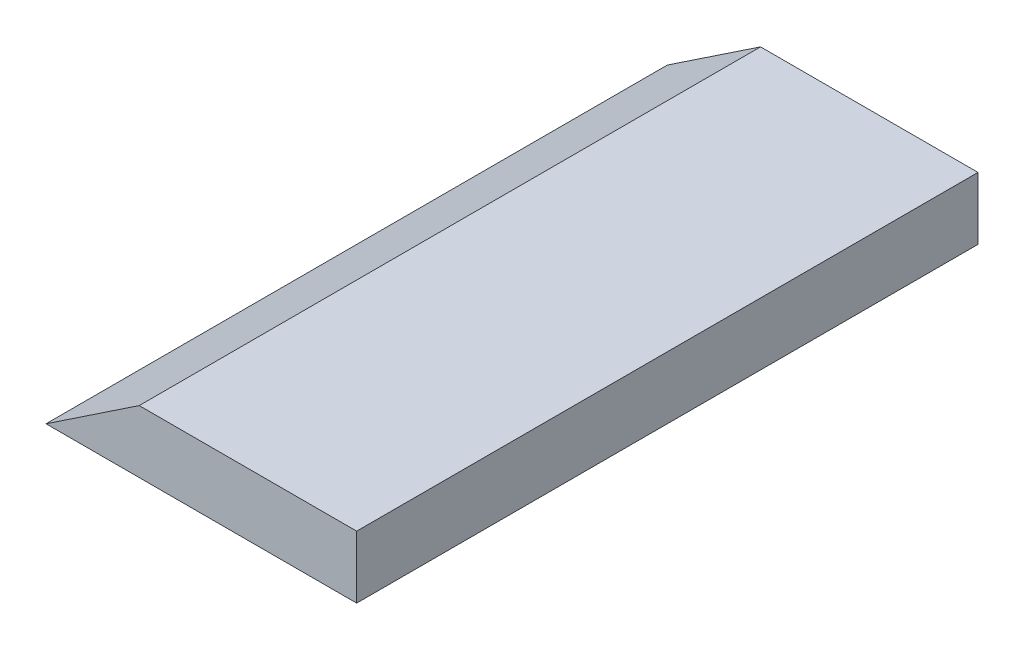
from build123d import *

# Parameters (mm, degrees)
BOSS_EXTRU_1_DEPTH = 10


with BuildPart() as part:
    # Esquisse1 → Boss.-Extru.1 (new body)
    with BuildSketch(Plane.XY):
        Polygon((-29.531675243, 0), (-24.531675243, 0), (-24.531675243, 1.0035319), (-28.031675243, 1.0035319), align=None)
    extrude(amount=BOSS_EXTRU_1_DEPTH)


solid = part.part
